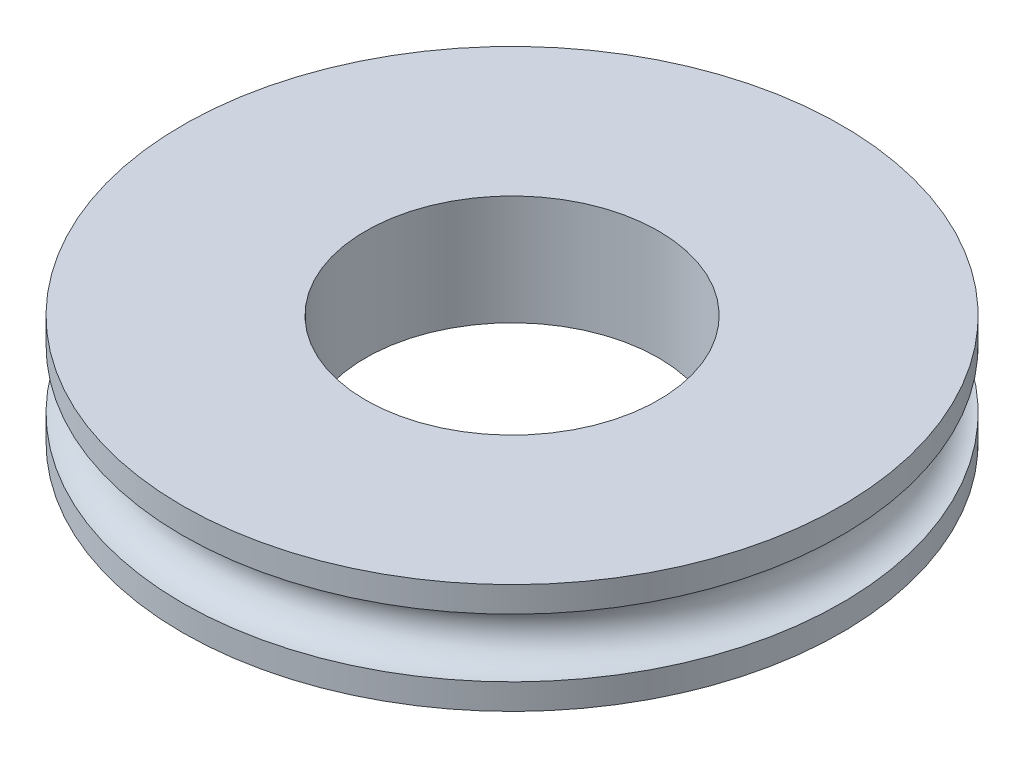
from build123d import *


with BuildPart() as part:
    # Sketch1 → Revolve1 (revolve)
    with BuildSketch(Plane.XY, mode=Mode.PRIVATE) as revolve1_sk:
        with BuildLine():
            Line((28.575, -2.54), (28.575, -4.7625))
            Line((28.575, -4.7625), (12.7, -4.7625))
            Line((12.7, -4.7625), (12.7, 4.7625))
            Line((12.7, 4.7625), (28.575, 4.7625))
            Line((28.575, 4.7625), (28.575, 2.54))
            ThreePointArc((28.575, 2.54), (26.035, 0), (28.575, -2.54))
        make_face()
    revolve(revolve1_sk.sketch.rotate(Axis((0, 27.495915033, 0), (0, -1, 0)), 90), axis=Axis((0, 27.495915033, 0), (0, -1, 0)))


solid = part.part
